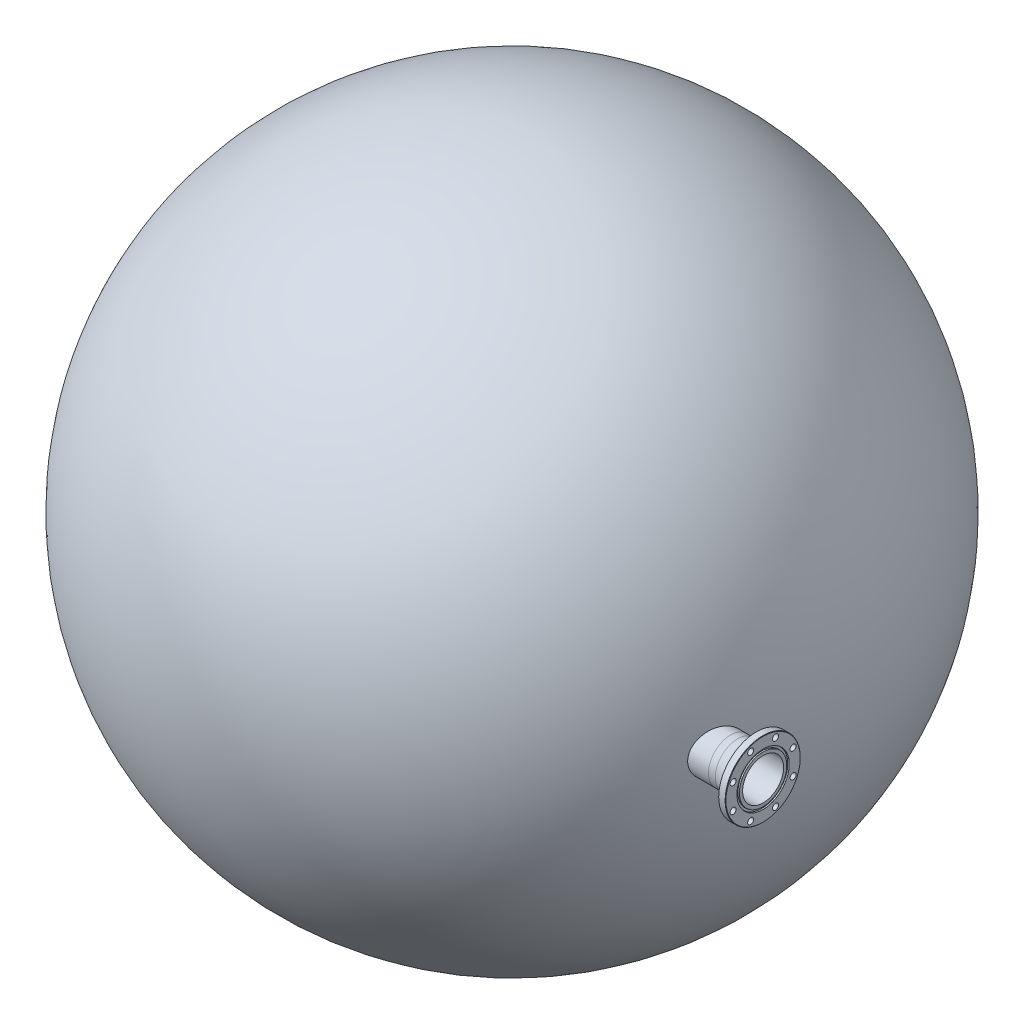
ISO-10303-21;
HEADER;
FILE_DESCRIPTION(('STEP AP214'),'2;1');
FILE_NAME('part.step','',(''),(''),'','','');
FILE_SCHEMA(('AUTOMOTIVE_DESIGN { 1 0 10303 214 1 1 1 1 }'));
ENDSEC;
DATA;
#1=APPLICATION_CONTEXT('core data for automotive mechanical design processes');
#2=APPLICATION_PROTOCOL_DEFINITION('international standard','automotive_design',2000,#1);
#3=PRODUCT_CONTEXT('',#1,'mechanical');
#4=PRODUCT('Part','Part','',(#3));
#5=PRODUCT_RELATED_PRODUCT_CATEGORY('part','',(#4));
#6=PRODUCT_DEFINITION_FORMATION('','',#4);
#7=PRODUCT_DEFINITION_CONTEXT('part definition',#1,'design');
#8=PRODUCT_DEFINITION('design','',#6,#7);
#9=PRODUCT_DEFINITION_SHAPE('','',#8);
#10=(LENGTH_UNIT() NAMED_UNIT(*) SI_UNIT(.MILLI.,.METRE.));
#11=(NAMED_UNIT(*) PLANE_ANGLE_UNIT() SI_UNIT($,.RADIAN.));
#12=(NAMED_UNIT(*) SI_UNIT($,.STERADIAN.) SOLID_ANGLE_UNIT());
#13=UNCERTAINTY_MEASURE_WITH_UNIT(LENGTH_MEASURE(1.E-05),#10,'distance_accuracy_value','');
#14=(GEOMETRIC_REPRESENTATION_CONTEXT(3) GLOBAL_UNCERTAINTY_ASSIGNED_CONTEXT((#13)) GLOBAL_UNIT_ASSIGNED_CONTEXT((#10,
#11,#12)) REPRESENTATION_CONTEXT('',''));
#15=CARTESIAN_POINT('',(0.,0.,0.));
#16=DIRECTION('',(0.,0.,1.));
#17=DIRECTION('',(1.,0.,0.));
#18=AXIS2_PLACEMENT_3D('',#15,#16,#17);
#19=CARTESIAN_POINT('',(-1206.5,0.,-393.7));
#20=DIRECTION('',(-1.,0.,0.));
#21=DIRECTION('',(0.,0.,-1.));
#22=AXIS2_PLACEMENT_3D('',#19,#20,#21);
#23=SPHERICAL_SURFACE('',#22,1225.55);
#24=CARTESIAN_POINT('',(-30.6418592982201,-55.0623669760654,-52.674245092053));
#25=CARTESIAN_POINT('',(-30.391752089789,-54.3477765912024,-53.4212355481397));
#26=CARTESIAN_POINT('',(-30.1463332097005,-53.6172371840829,-54.1544582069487));
#27=CARTESIAN_POINT('',(-29.6653217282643,-52.1252727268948,-55.5919840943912));
#28=CARTESIAN_POINT('',(-29.4297278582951,-51.3638516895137,-56.296291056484));
#29=CARTESIAN_POINT('',(-28.9687396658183,-49.8109899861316,-57.6748079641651));
#30=CARTESIAN_POINT('',(-28.7433473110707,-49.0195435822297,-58.3490121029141));
#31=CARTESIAN_POINT('',(-28.3032346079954,-47.4078919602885,-59.6658584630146));
#32=CARTESIAN_POINT('',(-28.0885146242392,-46.5876857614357,-60.3084996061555));
#33=CARTESIAN_POINT('',(-27.6700576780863,-44.9192960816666,-61.5612352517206));
#34=CARTESIAN_POINT('',(-27.4663271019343,-44.0710967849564,-62.1713108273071));
#35=CARTESIAN_POINT('',(-27.0703742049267,-42.3484048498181,-63.3572904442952));
#36=CARTESIAN_POINT('',(-26.8781529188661,-41.4739098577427,-63.9331914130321));
#37=CARTESIAN_POINT('',(-26.505656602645,-39.700200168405,-65.049458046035));
#38=CARTESIAN_POINT('',(-26.3253801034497,-38.8009885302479,-65.5898280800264));
#39=CARTESIAN_POINT('',(-25.9771094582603,-36.9791261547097,-66.633975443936));
#40=CARTESIAN_POINT('',(-25.80911644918,-36.0564732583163,-67.1377493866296));
#41=CARTESIAN_POINT('',(-25.4855555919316,-34.1879958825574,-68.1082285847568));
#42=CARTESIAN_POINT('',(-25.3300061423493,-33.2421396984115,-68.574878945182));
#43=CARTESIAN_POINT('',(-25.0319297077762,-31.3300820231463,-69.469274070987));
#44=CARTESIAN_POINT('',(-24.8894039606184,-30.3638786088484,-69.8970151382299));
#45=CARTESIAN_POINT('',(-24.6177188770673,-28.4129843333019,-70.7125164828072));
#46=CARTESIAN_POINT('',(-24.4885585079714,-27.4282949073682,-71.1002798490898));
#47=CARTESIAN_POINT('',(-24.2438715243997,-25.4420233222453,-71.8349832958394));
#48=CARTESIAN_POINT('',(-24.1283462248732,-24.4404395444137,-72.1819194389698));
#49=CARTESIAN_POINT('',(-23.9112438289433,-22.4226233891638,-72.8339877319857));
#50=CARTESIAN_POINT('',(-23.809662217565,-21.4063958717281,-73.1391334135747));
#51=CARTESIAN_POINT('',(-23.62062932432,-19.3607605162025,-73.7070410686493));
#52=CARTESIAN_POINT('',(-23.5331794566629,-18.3313513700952,-73.9697988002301));
#53=CARTESIAN_POINT('',(-23.3726371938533,-16.2614870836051,-74.4522195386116));
#54=CARTESIAN_POINT('',(-23.2995430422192,-15.2210333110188,-74.6718878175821));
#55=CARTESIAN_POINT('',(-23.1678673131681,-13.1309316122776,-75.067639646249));
#56=CARTESIAN_POINT('',(-23.1092871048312,-12.0812828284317,-75.2437190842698));
#57=CARTESIAN_POINT('',(-22.9585890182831,-8.98401438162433,-75.696709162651));
#58=CARTESIAN_POINT('',(-22.8867334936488,-6.92610659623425,-75.91273832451));
#59=CARTESIAN_POINT('',(-22.7989455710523,-2.79866213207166,-76.1766724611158));
#60=CARTESIAN_POINT('',(-22.7830120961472,-0.729125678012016,-76.2245806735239));
#61=CARTESIAN_POINT('',(-22.807186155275,3.40654838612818,-76.1518985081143));
#62=CARTESIAN_POINT('',(-22.8472888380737,5.47268627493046,-76.03132271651));
#63=CARTESIAN_POINT('',(-22.9831675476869,9.58647205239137,-75.6228290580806));
#64=CARTESIAN_POINT('',(-23.0789432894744,11.6341200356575,-75.3349120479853));
#65=CARTESIAN_POINT('',(-23.3233085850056,15.6632734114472,-74.6004520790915));
#66=CARTESIAN_POINT('',(-23.4710212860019,17.6453129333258,-74.1565428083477));
#67=CARTESIAN_POINT('',(-23.8182183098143,21.5633956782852,-73.1134037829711));
#68=CARTESIAN_POINT('',(-24.0177018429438,23.4994396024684,-72.5141763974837));
#69=CARTESIAN_POINT('',(-24.4667601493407,27.3125527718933,-71.1656810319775));
#70=CARTESIAN_POINT('',(-24.7163355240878,29.1896213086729,-70.4164112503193));
#71=CARTESIAN_POINT('',(-25.263527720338,32.872570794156,-68.7742648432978));
#72=CARTESIAN_POINT('',(-25.5611453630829,34.6784505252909,-67.8813857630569));
#73=CARTESIAN_POINT('',(-26.2073877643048,38.2370804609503,-65.943449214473));
#74=CARTESIAN_POINT('',(-26.5567786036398,39.9884473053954,-64.8961075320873));
#75=CARTESIAN_POINT('',(-27.2999936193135,43.3950917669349,-62.6693478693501));
#76=CARTESIAN_POINT('',(-27.6938180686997,45.0503687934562,-61.4899290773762));
#77=CARTESIAN_POINT('',(-28.5229482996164,48.2553153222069,-59.0082423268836));
#78=CARTESIAN_POINT('',(-28.9582589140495,49.8049724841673,-57.7059600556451));
#79=CARTESIAN_POINT('',(-29.8671457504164,52.7898832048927,-54.9885632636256));
#80=CARTESIAN_POINT('',(-30.3407229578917,54.2251338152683,-53.5734458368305));
#81=CARTESIAN_POINT('',(-31.3433964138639,57.0312415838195,-50.5792593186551));
#82=CARTESIAN_POINT('',(-31.8739867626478,58.3968894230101,-48.9958071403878));
#83=CARTESIAN_POINT('',(-32.9692544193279,60.9884904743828,-45.729538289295));
#84=CARTESIAN_POINT('',(-33.5339325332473,62.2144403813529,-44.0467192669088));
#85=CARTESIAN_POINT('',(-34.6935490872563,64.5206664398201,-40.5935353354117));
#86=CARTESIAN_POINT('',(-35.2884928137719,65.6009170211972,-38.8231551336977));
#87=CARTESIAN_POINT('',(-36.5045854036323,67.6103877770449,-35.20729990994));
#88=CARTESIAN_POINT('',(-37.1257349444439,68.5396040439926,-33.3618229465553));
#89=CARTESIAN_POINT('',(-38.4224734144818,70.2862371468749,-29.5123116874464));
#90=CARTESIAN_POINT('',(-39.0992238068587,71.0955507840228,-27.5049888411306));
#91=CARTESIAN_POINT('',(-40.4726357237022,72.5389988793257,-23.4349379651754));
#92=CARTESIAN_POINT('',(-41.1692978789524,73.1731277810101,-21.3722081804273));
#93=CARTESIAN_POINT('',(-42.5780214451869,74.2635038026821,-17.2049828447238));
#94=CARTESIAN_POINT('',(-43.2900856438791,74.7197184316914,-15.1004797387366));
#95=CARTESIAN_POINT('',(-44.7248577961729,75.452206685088,-10.8639749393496));
#96=CARTESIAN_POINT('',(-45.4475659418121,75.7284770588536,-8.73197274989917));
#97=CARTESIAN_POINT('',(-46.9282725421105,76.1074826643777,-4.36798163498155));
#98=CARTESIAN_POINT('',(-47.6865190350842,76.2027721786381,-2.1354271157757));
#99=CARTESIAN_POINT('',(-49.20428941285,76.1971048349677,2.32904078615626));
#100=CARTESIAN_POINT('',(-49.9638133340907,76.0961422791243,4.56095414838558));
#101=CARTESIAN_POINT('',(-51.4789602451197,75.6985144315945,9.00894615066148));
#102=CARTESIAN_POINT('',(-52.2345827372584,75.4018247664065,11.225022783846));
#103=CARTESIAN_POINT('',(-53.7365200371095,74.6141882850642,15.6255978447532));
#104=CARTESIAN_POINT('',(-54.4828348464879,74.1232415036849,17.8100962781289));
#105=CARTESIAN_POINT('',(-55.9697482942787,72.9423748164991,22.1582064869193));
#106=CARTESIAN_POINT('',(-56.7101685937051,72.2501199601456,24.3212459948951));
#107=CARTESIAN_POINT('',(-58.1703761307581,70.6725766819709,28.5830334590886));
#108=CARTESIAN_POINT('',(-58.8901630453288,69.7872852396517,30.6817804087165));
#109=CARTESIAN_POINT('',(-60.3033873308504,67.8283628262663,34.7987007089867));
#110=CARTESIAN_POINT('',(-60.9968254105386,66.7547369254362,36.8168762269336));
#111=CARTESIAN_POINT('',(-62.3516171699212,64.4250742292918,40.7564255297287));
#112=CARTESIAN_POINT('',(-63.0129717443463,63.169042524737,42.677802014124));
#113=CARTESIAN_POINT('',(-64.2824028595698,60.5141971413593,46.3627464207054));
#114=CARTESIAN_POINT('',(-64.8913772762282,59.1195350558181,48.1289954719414));
#115=CARTESIAN_POINT('',(-66.0679325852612,56.1717202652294,51.5388852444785));
#116=CARTESIAN_POINT('',(-66.6355137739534,54.6185686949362,53.1825268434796));
#117=CARTESIAN_POINT('',(-67.7238762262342,51.3639906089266,56.3321165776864));
#118=CARTESIAN_POINT('',(-68.244667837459,49.6625970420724,57.8380951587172));
#119=CARTESIAN_POINT('',(-69.2344447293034,46.1228038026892,60.6984687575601));
#120=CARTESIAN_POINT('',(-69.7034325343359,44.2844108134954,62.0528711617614));
#121=CARTESIAN_POINT('',(-70.5621736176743,40.5811944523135,64.5314986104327));
#122=CARTESIAN_POINT('',(-70.9547524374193,38.7225308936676,65.6639528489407));
#123=CARTESIAN_POINT('',(-71.6850007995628,34.9067238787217,67.769524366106));
#124=CARTESIAN_POINT('',(-72.0226720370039,32.949583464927,68.7426465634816));
#125=CARTESIAN_POINT('',(-72.6395214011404,28.9517016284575,70.5196631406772));
#126=CARTESIAN_POINT('',(-72.9187162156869,26.9109842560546,71.3236058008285));
#127=CARTESIAN_POINT('',(-73.4157154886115,22.7611010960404,72.7543034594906));
#128=CARTESIAN_POINT('',(-73.6335224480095,20.6519381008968,73.3810656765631));
#129=CARTESIAN_POINT('',(-73.9953638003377,16.4964328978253,74.42208842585));
#130=CARTESIAN_POINT('',(-74.1427243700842,14.4527756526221,74.8459318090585));
#131=CARTESIAN_POINT('',(-74.3787838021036,10.3342953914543,75.5248137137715));
#132=CARTESIAN_POINT('',(-74.467484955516,8.25947359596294,75.7798588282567));
#133=CARTESIAN_POINT('',(-74.5852940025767,4.09457717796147,76.1185856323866));
#134=CARTESIAN_POINT('',(-74.6144123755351,2.00450530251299,76.2022974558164));
#135=CARTESIAN_POINT('',(-74.6127807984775,-2.17541811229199,76.1976067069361));
#136=CARTESIAN_POINT('',(-74.5820315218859,-4.26526965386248,76.1092060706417));
#137=CARTESIAN_POINT('',(-74.4627626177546,-8.36803384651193,75.7662802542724));
#138=CARTESIAN_POINT('',(-74.3759569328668,-10.3814105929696,75.5166836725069));
#139=CARTESIAN_POINT('',(-74.1470921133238,-14.3787624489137,74.8584932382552));
#140=CARTESIAN_POINT('',(-74.005034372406,-16.3627382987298,74.4499033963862));
#141=CARTESIAN_POINT('',(-73.667041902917,-20.2875121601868,73.4775083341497));
#142=CARTESIAN_POINT('',(-73.4711083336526,-22.2283110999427,72.9137064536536));
#143=CARTESIAN_POINT('',(-73.0272103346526,-26.0537065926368,71.635962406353));
#144=CARTESIAN_POINT('',(-72.7792451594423,-27.9383023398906,70.9220180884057));
#145=CARTESIAN_POINT('',(-72.2314055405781,-31.6535666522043,69.344048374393));
#146=CARTESIAN_POINT('',(-71.9311379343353,-33.4836940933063,68.4788860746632));
#147=CARTESIAN_POINT('',(-71.2827493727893,-37.0627571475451,66.6098189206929));
#148=CARTESIAN_POINT('',(-70.9346284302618,-38.8116927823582,65.6059141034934));
#149=CARTESIAN_POINT('',(-70.1934854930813,-42.2180055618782,63.4675068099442));
#150=CARTESIAN_POINT('',(-69.8004587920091,-43.8753730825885,62.3329906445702));
#151=CARTESIAN_POINT('',(-68.9727576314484,-47.0888940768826,59.9423629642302));
#152=CARTESIAN_POINT('',(-68.5380820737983,-48.6450448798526,58.6862482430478));
#153=CARTESIAN_POINT('',(-67.6125266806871,-51.7071007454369,56.0099289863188));
#154=CARTESIAN_POINT('',(-67.1201040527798,-53.2085857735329,54.5852000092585));
#155=CARTESIAN_POINT('',(-66.0978791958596,-56.0847918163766,51.6255226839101));
#156=CARTESIAN_POINT('',(-65.5680761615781,-57.4595100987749,50.0905719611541));
#157=CARTESIAN_POINT('',(-64.4750305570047,-60.0752928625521,46.921438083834));
#158=CARTESIAN_POINT('',(-63.9117820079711,-61.3163333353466,45.2872371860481));
#159=CARTESIAN_POINT('',(-62.7560026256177,-63.6584384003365,41.9312610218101));
#160=CARTESIAN_POINT('',(-62.1634709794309,-64.7594991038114,40.2094833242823));
#161=CARTESIAN_POINT('',(-60.9206801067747,-66.871822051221,36.595251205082));
#162=CARTESIAN_POINT('',(-60.2690296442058,-67.875084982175,34.6985966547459));
#163=CARTESIAN_POINT('',(-58.942488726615,-69.7156449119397,30.8342275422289));
#164=CARTESIAN_POINT('',(-58.267597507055,-70.5529364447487,28.8665106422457));
#165=CARTESIAN_POINT('',(-56.8991824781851,-72.0577617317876,24.8731280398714));
#166=CARTESIAN_POINT('',(-56.2056557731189,-72.7252689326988,22.8474533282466));
#167=CARTESIAN_POINT('',(-54.8047290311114,-73.8873576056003,18.7517983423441));
#168=CARTESIAN_POINT('',(-54.0973287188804,-74.3819356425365,16.6818171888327));
#169=CARTESIAN_POINT('',(-52.6407342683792,-75.2145593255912,12.4155722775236));
#170=CARTESIAN_POINT('',(-51.8911063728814,-75.5444289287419,10.2178572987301));
#171=CARTESIAN_POINT('',(-50.3869239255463,-76.0110768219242,5.80364939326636));
#172=CARTESIAN_POINT('',(-49.6323692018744,-76.1478483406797,3.58715581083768));
#173=CARTESIAN_POINT('',(-48.1232332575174,-76.2275741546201,-0.850256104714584));
#174=CARTESIAN_POINT('',(-47.3686521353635,-76.1704549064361,-3.07117579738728));
#175=CARTESIAN_POINT('',(-45.8649144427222,-75.862375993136,-7.50135127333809));
#176=CARTESIAN_POINT('',(-45.1157578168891,-75.6114183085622,-9.71060717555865));
#177=CARTESIAN_POINT('',(-43.6138369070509,-74.9100743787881,-14.143994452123));
#178=CARTESIAN_POINT('',(-42.8612747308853,-74.4559879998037,-16.367610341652));
#179=CARTESIAN_POINT('',(-41.3724696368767,-73.3496200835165,-20.7708093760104));
#180=CARTESIAN_POINT('',(-40.636228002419,-72.6973230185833,-22.9503890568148));
#181=CARTESIAN_POINT('',(-39.1863342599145,-71.1985395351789,-27.2466302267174));
#182=CARTESIAN_POINT('',(-38.4726591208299,-70.3522588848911,-29.3633557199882));
#183=CARTESIAN_POINT('',(-37.0726213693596,-68.4696056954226,-33.5194711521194));
#184=CARTESIAN_POINT('',(-36.3862517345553,-67.4332824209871,-35.5588809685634));
#185=CARTESIAN_POINT('',(-35.2583225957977,-65.5336555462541,-38.9131120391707));
#186=CARTESIAN_POINT('',(-34.8080365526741,-64.7194037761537,-40.2529712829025));
#187=CARTESIAN_POINT('',(-34.145388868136,-63.4352855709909,-42.2258228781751));
#188=CARTESIAN_POINT('',(-33.9266529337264,-62.9968256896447,-42.8772349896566));
#189=CARTESIAN_POINT('',(-33.4935952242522,-62.0991958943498,-44.1672673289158));
#190=CARTESIAN_POINT('',(-33.2792740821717,-61.6400230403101,-44.805885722));
#191=CARTESIAN_POINT('',(-32.6433276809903,-60.2320674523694,-46.7013393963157));
#192=CARTESIAN_POINT('',(-32.2286469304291,-59.252707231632,-47.937989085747));
#193=CARTESIAN_POINT('',(-31.4195916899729,-57.2155128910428,-50.3519580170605));
#194=CARTESIAN_POINT('',(-31.0252180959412,-56.157675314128,-51.5292746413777));
#195=CARTESIAN_POINT('',(-30.6418592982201,-55.0623669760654,-52.674245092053));
#196=B_SPLINE_CURVE_WITH_KNOTS('',3,(#24,#25,#26,#27,#28,#29,#30,#31,#32,#33,#34,#35,#36,#37,
#38,#39,#40,#41,#42,#43,#44,#45,#46,#47,#48,#49,#50,#51,#52,#53,#54,#55,#56,#57,#58,#59,#60,#61,
#62,#63,#64,#65,#66,#67,#68,#69,#70,#71,#72,#73,#74,#75,#76,#77,#78,#79,#80,#81,#82,#83,#84,#85,
#86,#87,#88,#89,#90,#91,#92,#93,#94,#95,#96,#97,#98,#99,#100,#101,#102,#103,#104,#105,#106,#107,
#108,#109,#110,#111,#112,#113,#114,#115,#116,#117,#118,#119,#120,#121,#122,#123,#124,#125,#126,
#127,#128,#129,#130,#131,#132,#133,#134,#135,#136,#137,#138,#139,#140,#141,#142,#143,#144,#145,
#146,#147,#148,#149,#150,#151,#152,#153,#154,#155,#156,#157,#158,#159,#160,#161,#162,#163,#164,
#165,#166,#167,#168,#169,#170,#171,#172,#173,#174,#175,#176,#177,#178,#179,#180,#181,#182,#183,
#184,#185,#186,#187,#188,#189,#190,#191,#192,#193,#194,#195),.UNSPECIFIED.,.T.,.F.,(4,2,2,2,2,2,
2,2,2,2,2,2,2,2,2,2,2,2,2,2,2,2,2,2,2,2,2,2,2,2,2,2,2,2,2,2,2,2,2,2,2,2,2,2,2,2,2,2,2,2,2,2,2,2,
2,2,2,2,2,2,2,2,2,2,2,2,2,2,2,2,2,2,2,2,2,2,2,2,2,2,2,2,2,2,2,4),(0.,3.19039963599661,
6.3803860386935,9.57098515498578,12.7616931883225,15.9542358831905,19.1470651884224,
22.3395010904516,25.5322320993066,28.729599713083,31.9272709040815,35.1246948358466,
38.3224268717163,41.5191210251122,44.7161348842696,47.9127573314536,51.1096811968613,
57.312810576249,63.5158204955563,69.7182934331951,75.9207346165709,82.0231251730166,
88.1254226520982,94.2277934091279,100.330268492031,106.534248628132,112.738266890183,
118.94300877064,125.147910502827,131.612511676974,138.077265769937,144.543152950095,
151.009207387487,157.804546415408,164.600100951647,171.396895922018,178.193813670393,
185.264770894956,192.335933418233,199.407976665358,206.480018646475,213.637604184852,
220.795301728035,227.952806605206,235.110111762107,242.095593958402,249.081026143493,
256.064909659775,263.048452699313,269.674850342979,276.301043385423,282.925342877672,
289.549372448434,295.818653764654,302.087690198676,308.355623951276,314.623487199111,
320.70824146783,326.792842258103,332.877312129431,338.961869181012,345.094311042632,
351.226751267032,357.359834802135,363.493080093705,369.868848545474,376.244754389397,
382.621803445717,388.999029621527,395.718774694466,402.438741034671,409.159757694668,
415.880907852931,422.908867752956,429.937074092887,436.9679465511,443.998747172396,
451.163191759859,458.328197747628,465.485638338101,472.641226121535,477.532044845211,
479.977076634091,482.422456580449,487.31241504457,492.202589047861),.UNSPECIFIED.);
#197=CARTESIAN_POINT('',(-30.6418592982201,-55.0623669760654,-52.674245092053));
#198=VERTEX_POINT('',#197);
#199=EDGE_CURVE('E12',#198,#198,#196,.T.);
#200=ORIENTED_EDGE('',*,*,#199,.T.);
#201=EDGE_LOOP('',(#200));
#202=FACE_BOUND('',#201,.T.);
#203=CARTESIAN_POINT('',(-29.6242016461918,-59.7163890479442,-56.9952257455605));
#204=CARTESIAN_POINT('',(-29.353156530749,-58.9430859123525,-57.805451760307));
#205=CARTESIAN_POINT('',(-29.0871880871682,-58.1524838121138,-58.6007786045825));
#206=CARTESIAN_POINT('',(-28.5658899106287,-56.5377771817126,-60.1601326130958));
#207=CARTESIAN_POINT('',(-28.310558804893,-55.7136770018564,-60.924163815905));
#208=CARTESIAN_POINT('',(-27.8109383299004,-54.0329115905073,-62.419649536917));
#209=CARTESIAN_POINT('',(-27.5666510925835,-53.1762401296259,-63.1510977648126));
#210=CARTESIAN_POINT('',(-27.0896287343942,-51.4316969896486,-64.5798283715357));
#211=CARTESIAN_POINT('',(-26.8568940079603,-50.543824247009,-65.2771095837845));
#212=CARTESIAN_POINT('',(-26.40331190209,-48.737723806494,-66.6364386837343));
#213=CARTESIAN_POINT('',(-26.1824714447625,-47.8194789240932,-67.298466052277));
#214=CARTESIAN_POINT('',(-25.7532457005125,-45.9544577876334,-68.5855241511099));
#215=CARTESIAN_POINT('',(-25.5448615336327,-45.0076789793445,-69.2105515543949));
#216=CARTESIAN_POINT('',(-25.1410215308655,-43.0872937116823,-70.4221301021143));
#217=CARTESIAN_POINT('',(-24.9455641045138,-42.1136905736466,-71.0086859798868));
#218=CARTESIAN_POINT('',(-24.5679403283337,-40.1410430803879,-72.1421742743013));
#219=CARTESIAN_POINT('',(-24.3857752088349,-39.1419963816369,-72.6891030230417));
#220=CARTESIAN_POINT('',(-24.0348899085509,-37.1187549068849,-73.7428190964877));
#221=CARTESIAN_POINT('',(-23.8661895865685,-36.0945257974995,-74.2495471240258));
#222=CARTESIAN_POINT('',(-23.542879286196,-34.0239760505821,-75.2208703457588));
#223=CARTESIAN_POINT('',(-23.3882706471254,-32.9776533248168,-75.6854615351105));
#224=CARTESIAN_POINT('',(-23.0935153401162,-30.8649279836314,-76.5713439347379));
#225=CARTESIAN_POINT('',(-22.9533675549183,-29.7985269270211,-76.9926384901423));
#226=CARTESIAN_POINT('',(-22.6878226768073,-27.6473716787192,-77.7910128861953));
#227=CARTESIAN_POINT('',(-22.5624270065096,-26.5626157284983,-78.16808846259));
#228=CARTESIAN_POINT('',(-22.3267263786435,-24.3771805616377,-78.87695970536));
#229=CARTESIAN_POINT('',(-22.216416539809,-23.2765066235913,-79.2087700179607));
#230=CARTESIAN_POINT('',(-22.0110842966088,-21.0608256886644,-79.8264806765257));
#231=CARTESIAN_POINT('',(-21.9160634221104,-19.9458172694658,-80.1123764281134));
#232=CARTESIAN_POINT('',(-21.7415548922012,-17.703778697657,-80.6374849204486));
#233=CARTESIAN_POINT('',(-21.6620653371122,-16.5767500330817,-80.8767033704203));
#234=CARTESIAN_POINT('',(-21.5187873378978,-14.3126765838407,-81.3079239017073));
#235=CARTESIAN_POINT('',(-21.455000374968,-13.1756308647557,-81.4999215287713));
#236=CARTESIAN_POINT('',(-21.2907527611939,-9.82029225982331,-81.9943327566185));
#237=CARTESIAN_POINT('',(-21.212216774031,-7.59077461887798,-82.2307806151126));
#238=CARTESIAN_POINT('',(-21.1156583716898,-3.11892639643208,-82.5214949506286));
#239=CARTESIAN_POINT('',(-21.0976347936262,-0.876596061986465,-82.5757649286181));
#240=CARTESIAN_POINT('',(-21.122235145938,3.60459412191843,-82.5016957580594));
#241=CARTESIAN_POINT('',(-21.1648538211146,5.84345425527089,-82.3733724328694));
#242=CARTESIAN_POINT('',(-21.3103495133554,10.3013488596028,-81.9353471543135));
#243=CARTESIAN_POINT('',(-21.4132262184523,12.5203834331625,-81.625646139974));
#244=CARTESIAN_POINT('',(-21.6761612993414,16.8868935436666,-80.8342669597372));
#245=CARTESIAN_POINT('',(-21.8352681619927,19.0349459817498,-80.3554506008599));
#246=CARTESIAN_POINT('',(-22.2095353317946,23.2814011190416,-79.229438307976));
#247=CARTESIAN_POINT('',(-22.4246947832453,25.3798045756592,-78.5822449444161));
#248=CARTESIAN_POINT('',(-22.9092614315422,29.5128853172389,-77.1251813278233));
#249=CARTESIAN_POINT('',(-23.1786692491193,31.5475618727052,-76.3153092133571));
#250=CARTESIAN_POINT('',(-23.7695278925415,35.5399409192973,-74.5398430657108));
#251=CARTESIAN_POINT('',(-24.0909796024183,37.4976421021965,-73.5742463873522));
#252=CARTESIAN_POINT('',(-24.789082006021,41.3553209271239,-71.478232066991));
#253=CARTESIAN_POINT('',(-25.1665545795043,43.2538169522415,-70.3453619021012));
#254=CARTESIAN_POINT('',(-25.9696522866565,46.9468540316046,-67.9364118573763));
#255=CARTESIAN_POINT('',(-26.3952777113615,48.7413944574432,-66.6603311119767));
#256=CARTESIAN_POINT('',(-27.2915004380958,52.216188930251,-63.9749487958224));
#257=CARTESIAN_POINT('',(-27.7621029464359,53.8964297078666,-62.565631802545));
#258=CARTESIAN_POINT('',(-28.7448133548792,57.1330780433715,-59.6246231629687));
#259=CARTESIAN_POINT('',(-29.2569223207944,58.689482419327,-58.0929283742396));
#260=CARTESIAN_POINT('',(-30.3412142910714,61.7324020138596,-54.8521377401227));
#261=CARTESIAN_POINT('',(-30.915011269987,63.2133034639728,-53.1383094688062));
#262=CARTESIAN_POINT('',(-32.0996083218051,66.0239008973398,-49.602894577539));
#263=CARTESIAN_POINT('',(-32.7104092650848,67.3535933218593,-47.781305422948));
#264=CARTESIAN_POINT('',(-33.9648847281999,69.8552819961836,-44.0431713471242));
#265=CARTESIAN_POINT('',(-34.6085649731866,71.0272506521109,-42.1266098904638));
#266=CARTESIAN_POINT('',(-35.9244210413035,73.2076786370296,-38.2120182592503));
#267=CARTESIAN_POINT('',(-36.5965976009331,74.21613373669,-36.2139859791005));
#268=CARTESIAN_POINT('',(-37.9999610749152,76.1120525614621,-32.0462459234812));
#269=CARTESIAN_POINT('',(-38.7324105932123,76.9907560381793,-29.8729748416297));
#270=CARTESIAN_POINT('',(-40.219021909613,78.5585148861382,-25.4662907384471));
#271=CARTESIAN_POINT('',(-40.9731843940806,79.2475642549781,-23.2328758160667));
#272=CARTESIAN_POINT('',(-42.4983454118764,80.433084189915,-18.7206760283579));
#273=CARTESIAN_POINT('',(-43.2693469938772,80.9295195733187,-16.4418829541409));
#274=CARTESIAN_POINT('',(-44.8230442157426,81.7275789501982,-11.8543765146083));
#275=CARTESIAN_POINT('',(-45.6057400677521,82.0291994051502,-9.54566260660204));
#276=CARTESIAN_POINT('',(-47.2096308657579,82.4446911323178,-4.81950881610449));
#277=CARTESIAN_POINT('',(-48.0311024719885,82.5504746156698,-2.40144842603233));
#278=CARTESIAN_POINT('',(-49.6756206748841,82.5495221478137,2.43413966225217));
#279=CARTESIAN_POINT('',(-50.4986673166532,82.4427800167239,4.85166734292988));
#280=CARTESIAN_POINT('',(-52.1407295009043,82.0173626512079,9.66974697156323));
#281=CARTESIAN_POINT('',(-52.9597445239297,81.6986607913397,12.0702967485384));
#282=CARTESIAN_POINT('',(-54.5878824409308,80.8508908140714,16.8373713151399));
#283=CARTESIAN_POINT('',(-55.3970053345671,80.3218226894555,19.2038961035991));
#284=CARTESIAN_POINT('',(-57.0094975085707,79.0480357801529,23.9152307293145));
#285=CARTESIAN_POINT('',(-57.8126714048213,78.3007271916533,26.2594085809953));
#286=CARTESIAN_POINT('',(-59.3968120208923,76.5969839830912,30.8782241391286));
#287=CARTESIAN_POINT('',(-60.1777783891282,75.640546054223,33.1528607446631));
#288=CARTESIAN_POINT('',(-61.7114363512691,73.5233487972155,37.615369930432));
#289=CARTESIAN_POINT('',(-62.4641286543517,72.3625945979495,39.8032446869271));
#290=CARTESIAN_POINT('',(-63.5670126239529,70.4735688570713,43.0060095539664));
#291=CARTESIAN_POINT('',(-63.9303285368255,69.819146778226,44.0605595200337));
#292=CARTESIAN_POINT('',(-64.6475140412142,68.4618689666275,46.1412735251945));
#293=CARTESIAN_POINT('',(-65.0013846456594,67.7590184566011,47.1674406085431));
#294=CARTESIAN_POINT('',(-65.6906452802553,66.3231117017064,49.1652808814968));
#295=CARTESIAN_POINT('',(-66.02627447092,65.591163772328,50.1376689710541));
#296=CARTESIAN_POINT('',(-66.6870304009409,64.0832185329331,52.0511982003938));
#297=CARTESIAN_POINT('',(-67.0121582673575,63.3072259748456,52.9923426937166));
#298=CARTESIAN_POINT('',(-67.651253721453,61.7122092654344,54.841561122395));
#299=CARTESIAN_POINT('',(-67.9652201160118,60.8931805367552,55.7496315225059));
#300=CARTESIAN_POINT('',(-68.5812022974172,59.2135307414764,57.5304987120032));
#301=CARTESIAN_POINT('',(-68.88321933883,58.3529140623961,58.4032992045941));
#302=CARTESIAN_POINT('',(-69.4745898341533,56.5914923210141,60.1116510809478));
#303=CARTESIAN_POINT('',(-69.7639446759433,55.6906916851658,60.9472065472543));
#304=CARTESIAN_POINT('',(-70.3292917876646,53.8504087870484,62.5791360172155));
#305=CARTESIAN_POINT('',(-70.6052854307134,52.9109305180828,63.3755140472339));
#306=CARTESIAN_POINT('',(-71.1432547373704,50.9948057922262,64.9272839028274));
#307=CARTESIAN_POINT('',(-71.405230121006,50.0181585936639,65.6826749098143));
#308=CARTESIAN_POINT('',(-71.9144770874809,48.0294656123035,67.1505791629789));
#309=CARTESIAN_POINT('',(-72.1617489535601,47.0174205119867,67.8630932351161));
#310=CARTESIAN_POINT('',(-72.6286755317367,45.0124327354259,69.2081295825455));
#311=CARTESIAN_POINT('',(-72.849095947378,44.021161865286,69.8428793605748));
#312=CARTESIAN_POINT('',(-73.2755696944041,42.0101198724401,71.0706706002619));
#313=CARTESIAN_POINT('',(-73.4816232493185,40.9903491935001,71.6637127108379));
#314=CARTESIAN_POINT('',(-73.8788548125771,38.9240522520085,72.8066940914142));
#315=CARTESIAN_POINT('',(-74.0700322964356,37.8775250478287,73.3566318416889));
#316=CARTESIAN_POINT('',(-74.4369928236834,35.7597478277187,74.4119779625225));
#317=CARTESIAN_POINT('',(-74.6127774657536,34.6885003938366,74.917390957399));
#318=CARTESIAN_POINT('',(-74.9484821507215,32.5233548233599,75.8823985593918));
#319=CARTESIAN_POINT('',(-75.1084050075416,31.4294607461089,76.3420012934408));
#320=CARTESIAN_POINT('',(-75.4119764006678,29.2210269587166,77.2142696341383));
#321=CARTESIAN_POINT('',(-75.5556266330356,28.1064894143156,77.6269401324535));
#322=CARTESIAN_POINT('',(-75.826281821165,25.8587956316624,78.4043324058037));
#323=CARTESIAN_POINT('',(-75.9532864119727,24.7256389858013,78.7690531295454));
#324=CARTESIAN_POINT('',(-76.1902921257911,22.4429791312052,79.4495660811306));
#325=CARTESIAN_POINT('',(-76.3002934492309,21.2934761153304,79.7653588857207));
#326=CARTESIAN_POINT('',(-76.4975211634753,19.0427653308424,80.3314922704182));
#327=CARTESIAN_POINT('',(-76.5856553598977,17.9422927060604,80.5844427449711));
#328=CARTESIAN_POINT('',(-76.7462084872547,15.7306936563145,81.0451955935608));
#329=CARTESIAN_POINT('',(-76.8186260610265,14.6195663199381,81.2529940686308));
#330=CARTESIAN_POINT('',(-76.9475398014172,12.3889588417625,81.6228775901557));
#331=CARTESIAN_POINT('',(-77.0040380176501,11.2694797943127,81.7849685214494));
#332=CARTESIAN_POINT('',(-77.1009827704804,9.02401006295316,82.063083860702));
#333=CARTESIAN_POINT('',(-77.1414277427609,7.89801875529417,82.1791037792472));
#334=CARTESIAN_POINT('',(-77.2061428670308,5.6420656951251,82.3647387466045));
#335=CARTESIAN_POINT('',(-77.2304174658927,4.51210512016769,82.434366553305));
#336=CARTESIAN_POINT('',(-77.2627472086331,2.24993056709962,82.5270982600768));
#337=CARTESIAN_POINT('',(-77.2708007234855,1.11771637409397,82.550197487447));
#338=CARTESIAN_POINT('',(-77.2706621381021,-1.14657922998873,82.5497999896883));
#339=CARTESIAN_POINT('',(-77.262471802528,-2.27866064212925,82.5263083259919));
#340=CARTESIAN_POINT('',(-77.2298690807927,-4.54077424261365,82.4327935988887));
#341=CARTESIAN_POINT('',(-77.2054551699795,-5.67080622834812,82.3627661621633));
#342=CARTESIAN_POINT('',(-77.1414299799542,-7.89319275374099,82.1791101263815));
#343=CARTESIAN_POINT('',(-77.1022897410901,-8.98567279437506,82.0668329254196));
#344=CARTESIAN_POINT('',(-77.0088858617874,-11.1647444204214,81.7988763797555));
#345=CARTESIAN_POINT('',(-76.9546208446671,-12.2513354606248,81.6431930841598));
#346=CARTESIAN_POINT('',(-76.8311068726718,-14.4165051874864,81.2888058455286));
#347=CARTESIAN_POINT('',(-76.7618597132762,-15.4950848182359,81.090107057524));
#348=CARTESIAN_POINT('',(-76.6085504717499,-17.6424957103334,80.6501500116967));
#349=CARTESIAN_POINT('',(-76.5244870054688,-18.711326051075,80.4088877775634));
#350=CARTESIAN_POINT('',(-76.2503762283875,-21.9001494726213,79.6220874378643));
#351=CARTESIAN_POINT('',(-76.0383726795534,-24.0031020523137,79.0134328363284));
#352=CARTESIAN_POINT('',(-75.5579050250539,-28.1480005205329,77.6335348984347));
#353=CARTESIAN_POINT('',(-75.2894401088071,-30.1899455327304,76.8622892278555));
#354=CARTESIAN_POINT('',(-74.696186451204,-34.2155435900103,75.1572596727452));
#355=CARTESIAN_POINT('',(-74.3709743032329,-36.1986170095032,74.2222537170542));
#356=CARTESIAN_POINT('',(-73.668625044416,-40.076968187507,72.2019420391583));
#357=CARTESIAN_POINT('',(-73.2914879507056,-41.9722459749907,71.1166363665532));
#358=CARTESIAN_POINT('',(-72.4884989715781,-45.6638042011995,68.8045296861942));
#359=CARTESIAN_POINT('',(-72.0626419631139,-47.4600741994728,67.5777137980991));
#360=CARTESIAN_POINT('',(-71.1657525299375,-50.9431499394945,64.9923261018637));
#361=CARTESIAN_POINT('',(-70.6947189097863,-52.6299527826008,63.6337508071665));
#362=CARTESIAN_POINT('',(-69.6916483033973,-55.9495748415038,60.7386878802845));
#363=CARTESIAN_POINT('',(-69.1579324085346,-57.5775965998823,59.1972799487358));
#364=CARTESIAN_POINT('',(-68.0499653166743,-60.6964779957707,55.9949649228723));
#365=CARTESIAN_POINT('',(-67.4757132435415,-62.1873346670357,54.3340552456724));
#366=CARTESIAN_POINT('',(-66.2909576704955,-65.0244197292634,50.9046236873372));
#367=CARTESIAN_POINT('',(-65.6804476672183,-66.3706220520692,49.136082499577));
#368=CARTESIAN_POINT('',(-64.4276945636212,-68.9115435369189,45.5040024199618));
#369=CARTESIAN_POINT('',(-63.7854505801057,-70.1062584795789,43.6404608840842));
#370=CARTESIAN_POINT('',(-62.4382880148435,-72.3988685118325,39.7280757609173));
#371=CARTESIAN_POINT('',(-61.731857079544,-73.4880757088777,37.6746582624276));
#372=CARTESIAN_POINT('',(-60.2938248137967,-75.4867883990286,33.4906413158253));
#373=CARTESIAN_POINT('',(-59.5622226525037,-76.3962879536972,31.3600393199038));
#374=CARTESIAN_POINT('',(-58.0788511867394,-78.0314640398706,27.0358459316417));
#375=CARTESIAN_POINT('',(-57.3270787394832,-78.7571117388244,24.8422447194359));
#376=CARTESIAN_POINT('',(-55.8085326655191,-80.0211353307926,20.4068244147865));
#377=CARTESIAN_POINT('',(-55.041758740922,-80.5595075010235,18.1650043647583));
#378=CARTESIAN_POINT('',(-53.4628824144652,-81.4668802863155,13.5441538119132));
#379=CARTESIAN_POINT('',(-52.6503108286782,-81.8270080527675,11.1635373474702));
#380=CARTESIAN_POINT('',(-51.019874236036,-82.338075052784,6.38170385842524));
#381=CARTESIAN_POINT('',(-50.202009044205,-82.4890069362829,3.98048611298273));
#382=CARTESIAN_POINT('',(-48.5662978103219,-82.5808737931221,-0.826999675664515));
#383=CARTESIAN_POINT('',(-47.7484518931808,-82.5217290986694,-3.23326928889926));
#384=CARTESIAN_POINT('',(-46.1186861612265,-82.1933934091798,-8.03342575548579));
#385=CARTESIAN_POINT('',(-45.3067662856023,-81.9242045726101,-10.4273127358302));
#386=CARTESIAN_POINT('',(-43.6790906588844,-81.1697682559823,-15.2313721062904));
#387=CARTESIAN_POINT('',(-42.8635543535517,-80.6805187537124,-17.6409918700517));
#388=CARTESIAN_POINT('',(-41.2502058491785,-79.4872228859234,-22.4127787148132));
#389=CARTESIAN_POINT('',(-40.4523950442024,-78.7831596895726,-24.774942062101));
#390=CARTESIAN_POINT('',(-38.8812842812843,-77.1645519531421,-29.4313420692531));
#391=CARTESIAN_POINT('',(-38.1079593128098,-76.2502306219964,-31.7256478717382));
#392=CARTESIAN_POINT('',(-36.5909264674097,-74.2155277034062,-36.2307026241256));
#393=CARTESIAN_POINT('',(-35.8472109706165,-73.0951995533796,-38.4414730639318));
#394=CARTESIAN_POINT('',(-34.6251844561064,-71.0413360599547,-42.0773773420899));
#395=CARTESIAN_POINT('',(-34.1374107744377,-70.1610037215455,-43.5295931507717));
#396=CARTESIAN_POINT('',(-33.4195915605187,-68.7725171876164,-45.6679926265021));
#397=CARTESIAN_POINT('',(-33.1826431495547,-68.298396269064,-46.3740853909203));
#398=CARTESIAN_POINT('',(-32.7135258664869,-67.3277115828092,-47.7724433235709));
#399=CARTESIAN_POINT('',(-32.481357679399,-66.8311446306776,-48.4647065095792));
#400=CARTESIAN_POINT('',(-31.7924499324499,-65.3084579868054,-50.5194399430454));
#401=CARTESIAN_POINT('',(-31.3432287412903,-64.2492008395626,-51.860087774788));
#402=CARTESIAN_POINT('',(-30.4667650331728,-62.0456336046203,-54.4772283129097));
#403=CARTESIAN_POINT('',(-30.0395234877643,-60.9013197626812,-55.7537181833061));
#404=CARTESIAN_POINT('',(-29.6242016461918,-59.7163890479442,-56.9952257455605));
#405=B_SPLINE_CURVE_WITH_KNOTS('',3,(#203,#204,#205,#206,#207,#208,#209,#210,#211,#212,#213,
#214,#215,#216,#217,#218,#219,#220,#221,#222,#223,#224,#225,#226,#227,#228,#229,#230,#231,#232,
#233,#234,#235,#236,#237,#238,#239,#240,#241,#242,#243,#244,#245,#246,#247,#248,#249,#250,#251,
#252,#253,#254,#255,#256,#257,#258,#259,#260,#261,#262,#263,#264,#265,#266,#267,#268,#269,#270,
#271,#272,#273,#274,#275,#276,#277,#278,#279,#280,#281,#282,#283,#284,#285,#286,#287,#288,#289,
#290,#291,#292,#293,#294,#295,#296,#297,#298,#299,#300,#301,#302,#303,#304,#305,#306,#307,#308,
#309,#310,#311,#312,#313,#314,#315,#316,#317,#318,#319,#320,#321,#322,#323,#324,#325,#326,#327,
#328,#329,#330,#331,#332,#333,#334,#335,#336,#337,#338,#339,#340,#341,#342,#343,#344,#345,#346,
#347,#348,#349,#350,#351,#352,#353,#354,#355,#356,#357,#358,#359,#360,#361,#362,#363,#364,#365,
#366,#367,#368,#369,#370,#371,#372,#373,#374,#375,#376,#377,#378,#379,#380,#381,#382,#383,#384,
#385,#386,#387,#388,#389,#390,#391,#392,#393,#394,#395,#396,#397,#398,#399,#400,#401,#402,#403,
#404),.UNSPECIFIED.,.T.,.F.,(4,2,2,2,2,2,2,2,2,2,2,2,2,2,2,2,2,2,2,2,2,2,2,2,2,2,2,2,2,2,2,2,2,
2,2,2,2,2,2,2,2,2,2,2,2,2,2,2,2,2,2,2,2,2,2,2,2,2,2,2,2,2,2,2,2,2,2,2,2,2,2,2,2,2,2,2,2,2,2,2,2,
2,2,2,2,2,2,2,2,2,2,2,2,2,2,2,2,2,2,2,4),(0.,3.45672820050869,6.91300891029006,10.3699540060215,
13.8270170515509,17.2860707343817,20.7454349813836,24.2043728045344,27.6636303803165,
31.1278990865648,34.592496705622,38.0568264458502,41.5214899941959,44.9850298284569,
48.4489160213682,51.9123782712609,55.3761670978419,62.0974052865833,68.81851431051,
75.5390409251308,82.2595327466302,88.8713557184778,95.4830777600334,102.094875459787,
108.706785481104,115.427586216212,122.148427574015,128.87004784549,135.591840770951,
142.593695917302,149.595715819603,156.598959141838,163.60238357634,170.961940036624,
178.321729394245,185.682862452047,193.04412921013,200.703153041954,208.362399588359,
216.022608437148,223.682817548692,231.437903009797,239.193111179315,246.94812470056,
250.826672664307,254.704803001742,258.491164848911,262.277118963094,266.063476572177,
269.849435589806,273.63497859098,277.420131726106,281.205360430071,284.990516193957,
288.582013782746,292.173455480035,295.765023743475,299.356218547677,302.946775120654,
306.536957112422,310.127217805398,313.717436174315,317.114203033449,320.511263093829,
323.907885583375,327.304838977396,330.700857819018,334.097217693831,337.493208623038,
340.889518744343,344.185337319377,347.481455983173,350.777179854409,354.073211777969,
360.663372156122,367.253627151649,373.895338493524,380.537047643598,387.179455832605,
393.822039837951,400.728184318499,407.634478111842,414.542014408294,421.449743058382,
428.729749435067,436.00999633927,443.291384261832,450.57291692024,458.187488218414,
465.802327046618,473.420053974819,481.037702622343,488.799867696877,496.562641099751,
504.317211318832,512.06977286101,517.367207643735,520.015515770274,522.664200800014,
527.960703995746,533.257441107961),.UNSPECIFIED.);
#406=CARTESIAN_POINT('',(-29.6242016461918,-59.7163890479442,-56.9952257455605));
#407=VERTEX_POINT('',#406);
#408=EDGE_CURVE('E56',#407,#407,#405,.T.);
#409=ORIENTED_EDGE('',*,*,#408,.F.);
#410=EDGE_LOOP('',(#409));
#411=FACE_BOUND('',#410,.T.);
#412=ADVANCED_FACE('F46',(#202,#411),#23,.F.);
#413=CARTESIAN_POINT('',(0.,0.,0.));
#414=DIRECTION('',(-1.,0.,0.));
#415=DIRECTION('',(0.,0.,1.));
#416=AXIS2_PLACEMENT_3D('',#413,#414,#415);
#417=PLANE('',#416);
#418=CARTESIAN_POINT('',(0.,0.,0.));
#419=DIRECTION('',(-1.,0.,0.));
#420=DIRECTION('',(0.,0.,1.));
#421=AXIS2_PLACEMENT_3D('',#418,#419,#420);
#422=CIRCLE('',#421,76.2);
#423=CARTESIAN_POINT('',(0.,0.,76.2));
#424=VERTEX_POINT('',#423);
#425=EDGE_CURVE('E60',#424,#424,#422,.T.);
#426=ORIENTED_EDGE('',*,*,#425,.T.);
#427=EDGE_LOOP('',(#426));
#428=FACE_BOUND('',#427,.T.);
#429=CARTESIAN_POINT('',(0.,0.,0.));
#430=DIRECTION('',(-1.,0.,0.));
#431=DIRECTION('',(0.,0.,1.));
#432=AXIS2_PLACEMENT_3D('',#429,#430,#431);
#433=CIRCLE('',#432,82.55);
#434=CARTESIAN_POINT('',(0.,0.,82.55));
#435=VERTEX_POINT('',#434);
#436=EDGE_CURVE('E64',#435,#435,#433,.T.);
#437=ORIENTED_EDGE('',*,*,#436,.F.);
#438=EDGE_LOOP('',(#437));
#439=FACE_BOUND('',#438,.T.);
#440=ADVANCED_FACE('F73',(#428,#439),#417,.F.);
#441=CARTESIAN_POINT('',(-500000.,0.,0.));
#442=DIRECTION('',(1.,0.,0.));
#443=DIRECTION('',(0.,0.,-1.));
#444=AXIS2_PLACEMENT_3D('',#441,#442,#443);
#445=CYLINDRICAL_SURFACE('',#444,82.55);
#446=ORIENTED_EDGE('',*,*,#408,.T.);
#447=EDGE_LOOP('',(#446));
#448=FACE_BOUND('',#447,.T.);
#449=ORIENTED_EDGE('',*,*,#436,.T.);
#450=EDGE_LOOP('',(#449));
#451=FACE_BOUND('',#450,.T.);
#452=ADVANCED_FACE('F69',(#448,#451),#445,.T.);
#453=CARTESIAN_POINT('',(-500000.,0.,0.));
#454=DIRECTION('',(1.,0.,0.));
#455=DIRECTION('',(0.,0.,-1.));
#456=AXIS2_PLACEMENT_3D('',#453,#454,#455);
#457=CYLINDRICAL_SURFACE('',#456,76.2);
#458=ORIENTED_EDGE('',*,*,#199,.F.);
#459=EDGE_LOOP('',(#458));
#460=FACE_BOUND('',#459,.T.);
#461=ORIENTED_EDGE('',*,*,#425,.F.);
#462=EDGE_LOOP('',(#461));
#463=FACE_BOUND('',#462,.T.);
#464=ADVANCED_FACE('F72',(#460,#463),#457,.F.);
#465=CLOSED_SHELL('',(#412,#440,#452,#464));
#466=MANIFOLD_SOLID_BREP('B2',#465);
#467=CARTESIAN_POINT('',(-1206.5,0.,-393.7));
#468=DIRECTION('',(-1.,0.,0.));
#469=DIRECTION('',(0.,0.,-1.));
#470=AXIS2_PLACEMENT_3D('',#467,#468,#469);
#471=SPHERICAL_SURFACE('',#470,1225.55);
#472=CARTESIAN_POINT('',(-2432.05,0.,-393.7));
#473=VERTEX_POINT('',#472);
#474=VERTEX_LOOP('',#473);
#475=FACE_BOUND('',#474,.T.);
#476=ADVANCED_FACE('F123',(#475),#471,.T.);
#477=CLOSED_SHELL('',(#476));
#478=MANIFOLD_SOLID_BREP('B7_NOT_SHOWN',#477);
#479=CARTESIAN_POINT('',(0.,0.,-82.55));
#480=DIRECTION('',(1.,0.,0.));
#481=DIRECTION('',(0.,0.,-1.));
#482=AXIS2_PLACEMENT_3D('',#479,#480,#481);
#483=PLANE('',#482);
#484=CARTESIAN_POINT('',(0.,0.,0.));
#485=DIRECTION('',(-1.,0.,0.));
#486=DIRECTION('',(0.,0.,1.));
#487=AXIS2_PLACEMENT_3D('',#484,#485,#486);
#488=CIRCLE('',#487,76.2);
#489=CARTESIAN_POINT('',(0.,0.,76.2));
#490=VERTEX_POINT('',#489);
#491=EDGE_CURVE('E156',#490,#490,#488,.T.);
#492=ORIENTED_EDGE('',*,*,#491,.F.);
#493=EDGE_LOOP('',(#492));
#494=FACE_BOUND('',#493,.T.);
#495=CARTESIAN_POINT('',(0.,0.,0.));
#496=DIRECTION('',(-1.,0.,0.));
#497=DIRECTION('',(0.,0.,1.));
#498=AXIS2_PLACEMENT_3D('',#495,#496,#497);
#499=CIRCLE('',#498,82.55);
#500=CARTESIAN_POINT('',(0.,0.,82.55));
#501=VERTEX_POINT('',#500);
#502=EDGE_CURVE('E210',#501,#501,#499,.T.);
#503=ORIENTED_EDGE('',*,*,#502,.T.);
#504=EDGE_LOOP('',(#503));
#505=FACE_BOUND('',#504,.T.);
#506=ADVANCED_FACE('F136',(#494,#505),#483,.F.);
#507=CARTESIAN_POINT('',(0.,0.,0.));
#508=DIRECTION('',(-1.,0.,0.));
#509=DIRECTION('',(0.,0.,1.));
#510=AXIS2_PLACEMENT_3D('',#507,#508,#509);
#511=CYLINDRICAL_SURFACE('',#510,76.2);
#512=CARTESIAN_POINT('',(120.65,0.,0.));
#513=DIRECTION('',(-1.,0.,0.));
#514=DIRECTION('',(0.,0.,1.));
#515=AXIS2_PLACEMENT_3D('',#512,#513,#514);
#516=CIRCLE('',#515,76.2);
#517=CARTESIAN_POINT('',(120.65,0.,76.2));
#518=VERTEX_POINT('',#517);
#519=EDGE_CURVE('E177',#518,#518,#516,.T.);
#520=ORIENTED_EDGE('',*,*,#519,.F.);
#521=EDGE_LOOP('',(#520));
#522=FACE_BOUND('',#521,.T.);
#523=ORIENTED_EDGE('',*,*,#491,.T.);
#524=EDGE_LOOP('',(#523));
#525=FACE_BOUND('',#524,.T.);
#526=ADVANCED_FACE('F314',(#522,#525),#511,.F.);
#527=CARTESIAN_POINT('',(120.65,0.,-76.2));
#528=DIRECTION('',(-1.,0.,0.));
#529=DIRECTION('',(0.,0.,1.));
#530=AXIS2_PLACEMENT_3D('',#527,#528,#529);
#531=PLANE('',#530);
#532=CARTESIAN_POINT('',(120.65,0.,0.));
#533=DIRECTION('',(-1.,0.,0.));
#534=DIRECTION('',(0.,0.,1.));
#535=AXIS2_PLACEMENT_3D('',#532,#533,#534);
#536=CIRCLE('',#535,88.0194613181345);
#537=CARTESIAN_POINT('',(120.65,0.,88.0194613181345));
#538=VERTEX_POINT('',#537);
#539=EDGE_CURVE('E180',#538,#538,#536,.T.);
#540=ORIENTED_EDGE('',*,*,#539,.F.);
#541=EDGE_LOOP('',(#540));
#542=FACE_BOUND('',#541,.T.);
#543=ORIENTED_EDGE('',*,*,#519,.T.);
#544=EDGE_LOOP('',(#543));
#545=FACE_BOUND('',#544,.T.);
#546=ADVANCED_FACE('F308',(#542,#545),#531,.F.);
#547=CARTESIAN_POINT('',(120.523,0.,0.));
#548=DIRECTION('',(-1.,0.,0.));
#549=DIRECTION('',(0.,0.,1.));
#550=AXIS2_PLACEMENT_3D('',#547,#548,#549);
#551=TOROIDAL_SURFACE('',#550,88.0194613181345,0.126999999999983);
#552=CARTESIAN_POINT('',(120.534068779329,0.,0.));
#553=DIRECTION('',(-1.,0.,0.));
#554=DIRECTION('',(0.,0.,1.));
#555=AXIS2_PLACEMENT_3D('',#552,#553,#554);
#556=CIRCLE('',#555,88.1459780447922);
#557=CARTESIAN_POINT('',(120.534068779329,0.,88.1459780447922));
#558=VERTEX_POINT('',#557);
#559=EDGE_CURVE('E183',#558,#558,#556,.T.);
#560=ORIENTED_EDGE('',*,*,#559,.F.);
#561=EDGE_LOOP('',(#560));
#562=FACE_BOUND('',#561,.T.);
#563=ORIENTED_EDGE('',*,*,#539,.T.);
#564=EDGE_LOOP('',(#563));
#565=FACE_BOUND('',#564,.T.);
#566=ADVANCED_FACE('F302',(#562,#565),#551,.T.);
#567=CARTESIAN_POINT('',(120.534068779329,0.,0.));
#568=DIRECTION('',(-1.,0.,0.));
#569=DIRECTION('',(0.,0.,1.));
#570=AXIS2_PLACEMENT_3D('',#567,#568,#569);
#571=CONICAL_SURFACE('',#570,88.1459780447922,0.0872664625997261);
#572=CARTESIAN_POINT('',(115.660531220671,0.,0.));
#573=DIRECTION('',(-1.,0.,0.));
#574=DIRECTION('',(0.,0.,1.));
#575=AXIS2_PLACEMENT_3D('',#572,#573,#574);
#576=CIRCLE('',#575,88.5723573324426);
#577=CARTESIAN_POINT('',(115.660531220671,0.,88.5723573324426));
#578=VERTEX_POINT('',#577);
#579=EDGE_CURVE('E186',#578,#578,#576,.T.);
#580=ORIENTED_EDGE('',*,*,#579,.F.);
#581=EDGE_LOOP('',(#580));
#582=FACE_BOUND('',#581,.T.);
#583=ORIENTED_EDGE('',*,*,#559,.T.);
#584=EDGE_LOOP('',(#583));
#585=FACE_BOUND('',#584,.T.);
#586=ADVANCED_FACE('F296',(#582,#585),#571,.T.);
#587=CARTESIAN_POINT('',(115.6716,0.,0.));
#588=DIRECTION('',(-1.,0.,0.));
#589=DIRECTION('',(0.,0.,1.));
#590=AXIS2_PLACEMENT_3D('',#587,#588,#589);
#591=TOROIDAL_SURFACE('',#590,88.6988740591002,0.12699999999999);
#592=CARTESIAN_POINT('',(115.5446,0.,0.));
#593=DIRECTION('',(-1.,0.,0.));
#594=DIRECTION('',(0.,0.,1.));
#595=AXIS2_PLACEMENT_3D('',#592,#593,#594);
#596=CIRCLE('',#595,88.6988740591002);
#597=CARTESIAN_POINT('',(115.5446,0.,88.6988740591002));
#598=VERTEX_POINT('',#597);
#599=EDGE_CURVE('E189',#598,#598,#596,.T.);
#600=ORIENTED_EDGE('',*,*,#599,.F.);
#601=EDGE_LOOP('',(#600));
#602=FACE_BOUND('',#601,.T.);
#603=ORIENTED_EDGE('',*,*,#579,.T.);
#604=EDGE_LOOP('',(#603));
#605=FACE_BOUND('',#604,.T.);
#606=ADVANCED_FACE('F290',(#602,#605),#591,.F.);
#607=CARTESIAN_POINT('',(115.5446,0.,-88.6988740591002));
#608=DIRECTION('',(-1.,0.,0.));
#609=DIRECTION('',(0.,0.,1.));
#610=AXIS2_PLACEMENT_3D('',#607,#608,#609);
#611=PLANE('',#610);
#612=CARTESIAN_POINT('',(115.5446,0.,0.));
#613=DIRECTION('',(-1.,0.,0.));
#614=DIRECTION('',(0.,0.,1.));
#615=AXIS2_PLACEMENT_3D('',#612,#613,#614);
#616=CIRCLE('',#615,96.6449259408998);
#617=CARTESIAN_POINT('',(115.5446,0.,96.6449259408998));
#618=VERTEX_POINT('',#617);
#619=EDGE_CURVE('E192',#618,#618,#616,.T.);
#620=ORIENTED_EDGE('',*,*,#619,.F.);
#621=EDGE_LOOP('',(#620));
#622=FACE_BOUND('',#621,.T.);
#623=ORIENTED_EDGE('',*,*,#599,.T.);
#624=EDGE_LOOP('',(#623));
#625=FACE_BOUND('',#624,.T.);
#626=ADVANCED_FACE('F284',(#622,#625),#611,.F.);
#627=CARTESIAN_POINT('',(115.6716,0.,0.));
#628=DIRECTION('',(-1.,0.,0.));
#629=DIRECTION('',(0.,0.,1.));
#630=AXIS2_PLACEMENT_3D('',#627,#628,#629);
#631=TOROIDAL_SURFACE('',#630,96.6449259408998,0.12699999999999);
#632=CARTESIAN_POINT('',(115.660531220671,0.,0.));
#633=DIRECTION('',(-1.,0.,0.));
#634=DIRECTION('',(0.,0.,1.));
#635=AXIS2_PLACEMENT_3D('',#632,#633,#634);
#636=CIRCLE('',#635,96.7714426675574);
#637=CARTESIAN_POINT('',(115.660531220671,0.,96.7714426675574));
#638=VERTEX_POINT('',#637);
#639=EDGE_CURVE('E195',#638,#638,#636,.T.);
#640=ORIENTED_EDGE('',*,*,#639,.F.);
#641=EDGE_LOOP('',(#640));
#642=FACE_BOUND('',#641,.T.);
#643=ORIENTED_EDGE('',*,*,#619,.T.);
#644=EDGE_LOOP('',(#643));
#645=FACE_BOUND('',#644,.T.);
#646=ADVANCED_FACE('F278',(#642,#645),#631,.F.);
#647=CARTESIAN_POINT('',(115.660531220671,0.,0.));
#648=DIRECTION('',(1.,0.,0.));
#649=DIRECTION('',(0.,0.,-1.));
#650=AXIS2_PLACEMENT_3D('',#647,#648,#649);
#651=CONICAL_SURFACE('',#650,96.7714426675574,0.0872664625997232);
#652=CARTESIAN_POINT('',(120.534068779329,0.,0.));
#653=DIRECTION('',(-1.,0.,0.));
#654=DIRECTION('',(0.,0.,1.));
#655=AXIS2_PLACEMENT_3D('',#652,#653,#654);
#656=CIRCLE('',#655,97.1978219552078);
#657=CARTESIAN_POINT('',(120.534068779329,0.,97.1978219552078));
#658=VERTEX_POINT('',#657);
#659=EDGE_CURVE('E198',#658,#658,#656,.T.);
#660=ORIENTED_EDGE('',*,*,#659,.F.);
#661=EDGE_LOOP('',(#660));
#662=FACE_BOUND('',#661,.T.);
#663=ORIENTED_EDGE('',*,*,#639,.T.);
#664=EDGE_LOOP('',(#663));
#665=FACE_BOUND('',#664,.T.);
#666=ADVANCED_FACE('F272',(#662,#665),#651,.F.);
#667=CARTESIAN_POINT('',(120.523,0.,0.));
#668=DIRECTION('',(-1.,0.,0.));
#669=DIRECTION('',(0.,0.,1.));
#670=AXIS2_PLACEMENT_3D('',#667,#668,#669);
#671=TOROIDAL_SURFACE('',#670,97.3243386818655,0.126999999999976);
#672=CARTESIAN_POINT('',(120.65,0.,0.));
#673=DIRECTION('',(-1.,0.,0.));
#674=DIRECTION('',(0.,0.,1.));
#675=AXIS2_PLACEMENT_3D('',#672,#673,#674);
#676=CIRCLE('',#675,97.3243386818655);
#677=CARTESIAN_POINT('',(120.65,0.,97.3243386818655));
#678=VERTEX_POINT('',#677);
#679=EDGE_CURVE('E201',#678,#678,#676,.T.);
#680=ORIENTED_EDGE('',*,*,#679,.F.);
#681=EDGE_LOOP('',(#680));
#682=FACE_BOUND('',#681,.T.);
#683=ORIENTED_EDGE('',*,*,#659,.T.);
#684=EDGE_LOOP('',(#683));
#685=FACE_BOUND('',#684,.T.);
#686=ADVANCED_FACE('F251',(#682,#685),#671,.T.);
#687=CARTESIAN_POINT('',(120.65,0.,-97.3243386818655));
#688=DIRECTION('',(-1.,0.,0.));
#689=DIRECTION('',(0.,0.,1.));
#690=AXIS2_PLACEMENT_3D('',#687,#688,#689);
#691=PLANE('',#690);
#692=CARTESIAN_POINT('',(120.65,0.,0.));
#693=DIRECTION('',(-1.,0.,0.));
#694=DIRECTION('',(0.,0.,1.));
#695=AXIS2_PLACEMENT_3D('',#692,#693,#694);
#696=CIRCLE('',#695,138.1125);
#697=CARTESIAN_POINT('',(120.65,0.,138.1125));
#698=VERTEX_POINT('',#697);
#699=EDGE_CURVE('E147',#698,#698,#696,.F.);
#700=ORIENTED_EDGE('',*,*,#699,.T.);
#701=EDGE_LOOP('',(#700));
#702=FACE_BOUND('',#701,.T.);
#703=CARTESIAN_POINT('',(120.65,111.466065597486,46.1707561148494));
#704=DIRECTION('',(1.,0.,0.));
#705=DIRECTION('',(0.,0.,-1.));
#706=AXIS2_PLACEMENT_3D('',#703,#704,#705);
#707=CIRCLE('',#706,11.1125);
#708=CARTESIAN_POINT('',(120.65,111.466065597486,35.0582561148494));
#709=VERTEX_POINT('',#708);
#710=EDGE_CURVE('E161',#709,#709,#707,.T.);
#711=ORIENTED_EDGE('',*,*,#710,.F.);
#712=EDGE_LOOP('',(#711));
#713=FACE_BOUND('',#712,.T.);
#714=CARTESIAN_POINT('',(120.65,111.466065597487,-46.170756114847));
#715=DIRECTION('',(1.,0.,0.));
#716=DIRECTION('',(0.,0.,-1.));
#717=AXIS2_PLACEMENT_3D('',#714,#715,#716);
#718=CIRCLE('',#717,11.1125);
#719=CARTESIAN_POINT('',(120.65,111.466065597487,-57.283256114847));
#720=VERTEX_POINT('',#719);
#721=EDGE_CURVE('E160',#720,#720,#718,.T.);
#722=ORIENTED_EDGE('',*,*,#721,.F.);
#723=EDGE_LOOP('',(#722));
#724=FACE_BOUND('',#723,.T.);
#725=CARTESIAN_POINT('',(120.65,46.170756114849,-111.466065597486));
#726=DIRECTION('',(1.,0.,0.));
#727=DIRECTION('',(0.,0.,-1.));
#728=AXIS2_PLACEMENT_3D('',#725,#726,#727);
#729=CIRCLE('',#728,11.1125);
#730=CARTESIAN_POINT('',(120.65,46.170756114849,-122.578565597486));
#731=VERTEX_POINT('',#730);
#732=EDGE_CURVE('E165',#731,#731,#729,.T.);
#733=ORIENTED_EDGE('',*,*,#732,.F.);
#734=EDGE_LOOP('',(#733));
#735=FACE_BOUND('',#734,.T.);
#736=CARTESIAN_POINT('',(120.65,-46.1707561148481,-111.466065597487));
#737=DIRECTION('',(1.,0.,0.));
#738=DIRECTION('',(0.,0.,-1.));
#739=AXIS2_PLACEMENT_3D('',#736,#737,#738);
#740=CIRCLE('',#739,11.1125);
#741=CARTESIAN_POINT('',(120.65,-46.1707561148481,-122.578565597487));
#742=VERTEX_POINT('',#741);
#743=EDGE_CURVE('E231',#742,#742,#740,.T.);
#744=ORIENTED_EDGE('',*,*,#743,.F.);
#745=EDGE_LOOP('',(#744));
#746=FACE_BOUND('',#745,.T.);
#747=CARTESIAN_POINT('',(120.65,-111.466065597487,-46.1707561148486));
#748=DIRECTION('',(1.,0.,0.));
#749=DIRECTION('',(0.,0.,-1.));
#750=AXIS2_PLACEMENT_3D('',#747,#748,#749);
#751=CIRCLE('',#750,11.1125);
#752=CARTESIAN_POINT('',(120.65,-111.466065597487,-57.2832561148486));
#753=VERTEX_POINT('',#752);
#754=EDGE_CURVE('E170',#753,#753,#751,.T.);
#755=ORIENTED_EDGE('',*,*,#754,.F.);
#756=EDGE_LOOP('',(#755));
#757=FACE_BOUND('',#756,.T.);
#758=CARTESIAN_POINT('',(120.65,-111.466065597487,46.1707561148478));
#759=DIRECTION('',(1.,0.,0.));
#760=DIRECTION('',(0.,0.,-1.));
#761=AXIS2_PLACEMENT_3D('',#758,#759,#760);
#762=CIRCLE('',#761,11.1125);
#763=CARTESIAN_POINT('',(120.65,-111.466065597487,35.0582561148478));
#764=VERTEX_POINT('',#763);
#765=EDGE_CURVE('E169',#764,#764,#762,.T.);
#766=ORIENTED_EDGE('',*,*,#765,.F.);
#767=EDGE_LOOP('',(#766));
#768=FACE_BOUND('',#767,.T.);
#769=CARTESIAN_POINT('',(120.65,-46.1707561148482,111.466065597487));
#770=DIRECTION('',(1.,0.,0.));
#771=DIRECTION('',(0.,0.,-1.));
#772=AXIS2_PLACEMENT_3D('',#769,#770,#771);
#773=CIRCLE('',#772,11.1125);
#774=CARTESIAN_POINT('',(120.65,-46.1707561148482,100.353565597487));
#775=VERTEX_POINT('',#774);
#776=EDGE_CURVE('E174',#775,#775,#773,.T.);
#777=ORIENTED_EDGE('',*,*,#776,.F.);
#778=EDGE_LOOP('',(#777));
#779=FACE_BOUND('',#778,.T.);
#780=CARTESIAN_POINT('',(120.65,46.1707561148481,111.466065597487));
#781=DIRECTION('',(1.,0.,0.));
#782=DIRECTION('',(0.,0.,-1.));
#783=AXIS2_PLACEMENT_3D('',#780,#781,#782);
#784=CIRCLE('',#783,11.1125);
#785=CARTESIAN_POINT('',(120.65,46.1707561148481,100.353565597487));
#786=VERTEX_POINT('',#785);
#787=EDGE_CURVE('E216',#786,#786,#784,.T.);
#788=ORIENTED_EDGE('',*,*,#787,.F.);
#789=EDGE_LOOP('',(#788));
#790=FACE_BOUND('',#789,.T.);
#791=ORIENTED_EDGE('',*,*,#679,.T.);
#792=EDGE_LOOP('',(#791));
#793=FACE_BOUND('',#792,.T.);
#794=ADVANCED_FACE('F247',(#702,#713,#724,#735,#746,#757,#768,#779,#790,#793),#691,.F.);
#795=CARTESIAN_POINT('',(0.,0.,0.));
#796=DIRECTION('',(-1.,0.,0.));
#797=DIRECTION('',(0.,0.,1.));
#798=AXIS2_PLACEMENT_3D('',#795,#796,#797);
#799=CYLINDRICAL_SURFACE('',#798,139.7);
#800=CARTESIAN_POINT('',(119.0625,0.,0.));
#801=DIRECTION('',(-1.,0.,0.));
#802=DIRECTION('',(0.,0.,1.));
#803=AXIS2_PLACEMENT_3D('',#800,#801,#802);
#804=CIRCLE('',#803,139.7);
#805=CARTESIAN_POINT('',(119.0625,0.,139.7));
#806=VERTEX_POINT('',#805);
#807=EDGE_CURVE('E151',#806,#806,#804,.T.);
#808=ORIENTED_EDGE('',*,*,#807,.T.);
#809=EDGE_LOOP('',(#808));
#810=FACE_BOUND('',#809,.T.);
#811=CARTESIAN_POINT('',(95.25,0.,0.));
#812=DIRECTION('',(-1.,0.,0.));
#813=DIRECTION('',(0.,0.,1.));
#814=AXIS2_PLACEMENT_3D('',#811,#812,#813);
#815=CIRCLE('',#814,139.7);
#816=CARTESIAN_POINT('',(95.25,0.,139.7));
#817=VERTEX_POINT('',#816);
#818=EDGE_CURVE('E204',#817,#817,#815,.T.);
#819=ORIENTED_EDGE('',*,*,#818,.F.);
#820=EDGE_LOOP('',(#819));
#821=FACE_BOUND('',#820,.T.);
#822=ADVANCED_FACE('F250',(#810,#821),#799,.T.);
#823=CARTESIAN_POINT('',(95.25,0.,-139.7));
#824=DIRECTION('',(1.,0.,0.));
#825=DIRECTION('',(0.,0.,-1.));
#826=AXIS2_PLACEMENT_3D('',#823,#824,#825);
#827=PLANE('',#826);
#828=CARTESIAN_POINT('',(95.25,0.,0.));
#829=DIRECTION('',(1.,0.,0.));
#830=DIRECTION('',(0.,0.,-1.));
#831=AXIS2_PLACEMENT_3D('',#828,#829,#830);
#832=CIRCLE('',#831,103.199339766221);
#833=CARTESIAN_POINT('',(95.25,0.,-103.199339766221));
#834=VERTEX_POINT('',#833);
#835=EDGE_CURVE('E122',#834,#834,#832,.T.);
#836=ORIENTED_EDGE('',*,*,#835,.T.);
#837=EDGE_LOOP('',(#836));
#838=FACE_BOUND('',#837,.T.);
#839=CARTESIAN_POINT('',(95.25,111.466065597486,46.1707561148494));
#840=DIRECTION('',(1.,0.,0.));
#841=DIRECTION('',(0.,0.,-1.));
#842=AXIS2_PLACEMENT_3D('',#839,#840,#841);
#843=CIRCLE('',#842,11.1125);
#844=CARTESIAN_POINT('',(95.25,111.466065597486,35.0582561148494));
#845=VERTEX_POINT('',#844);
#846=EDGE_CURVE('E157',#845,#845,#843,.T.);
#847=ORIENTED_EDGE('',*,*,#846,.T.);
#848=EDGE_LOOP('',(#847));
#849=FACE_BOUND('',#848,.T.);
#850=CARTESIAN_POINT('',(95.25,111.466065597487,-46.170756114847));
#851=DIRECTION('',(1.,0.,0.));
#852=DIRECTION('',(0.,0.,-1.));
#853=AXIS2_PLACEMENT_3D('',#850,#851,#852);
#854=CIRCLE('',#853,11.1125);
#855=CARTESIAN_POINT('',(95.25,111.466065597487,-57.283256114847));
#856=VERTEX_POINT('',#855);
#857=EDGE_CURVE('E162',#856,#856,#854,.T.);
#858=ORIENTED_EDGE('',*,*,#857,.T.);
#859=EDGE_LOOP('',(#858));
#860=FACE_BOUND('',#859,.T.);
#861=CARTESIAN_POINT('',(95.25,46.170756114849,-111.466065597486));
#862=DIRECTION('',(1.,0.,0.));
#863=DIRECTION('',(0.,0.,-1.));
#864=AXIS2_PLACEMENT_3D('',#861,#862,#863);
#865=CIRCLE('',#864,11.1125);
#866=CARTESIAN_POINT('',(95.25,46.170756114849,-122.578565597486));
#867=VERTEX_POINT('',#866);
#868=EDGE_CURVE('E234',#867,#867,#865,.T.);
#869=ORIENTED_EDGE('',*,*,#868,.T.);
#870=EDGE_LOOP('',(#869));
#871=FACE_BOUND('',#870,.T.);
#872=CARTESIAN_POINT('',(95.25,-46.1707561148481,-111.466065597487));
#873=DIRECTION('',(1.,0.,0.));
#874=DIRECTION('',(0.,0.,-1.));
#875=AXIS2_PLACEMENT_3D('',#872,#873,#874);
#876=CIRCLE('',#875,11.1125);
#877=CARTESIAN_POINT('',(95.25,-46.1707561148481,-122.578565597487));
#878=VERTEX_POINT('',#877);
#879=EDGE_CURVE('E228',#878,#878,#876,.T.);
#880=ORIENTED_EDGE('',*,*,#879,.T.);
#881=EDGE_LOOP('',(#880));
#882=FACE_BOUND('',#881,.T.);
#883=CARTESIAN_POINT('',(95.25,-111.466065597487,-46.1707561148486));
#884=DIRECTION('',(1.,0.,0.));
#885=DIRECTION('',(0.,0.,-1.));
#886=AXIS2_PLACEMENT_3D('',#883,#884,#885);
#887=CIRCLE('',#886,11.1125);
#888=CARTESIAN_POINT('',(95.25,-111.466065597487,-57.2832561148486));
#889=VERTEX_POINT('',#888);
#890=EDGE_CURVE('E166',#889,#889,#887,.T.);
#891=ORIENTED_EDGE('',*,*,#890,.T.);
#892=EDGE_LOOP('',(#891));
#893=FACE_BOUND('',#892,.T.);
#894=CARTESIAN_POINT('',(95.25,-111.466065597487,46.1707561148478));
#895=DIRECTION('',(1.,0.,0.));
#896=DIRECTION('',(0.,0.,-1.));
#897=AXIS2_PLACEMENT_3D('',#894,#895,#896);
#898=CIRCLE('',#897,11.1125);
#899=CARTESIAN_POINT('',(95.25,-111.466065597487,35.0582561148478));
#900=VERTEX_POINT('',#899);
#901=EDGE_CURVE('E171',#900,#900,#898,.T.);
#902=ORIENTED_EDGE('',*,*,#901,.T.);
#903=EDGE_LOOP('',(#902));
#904=FACE_BOUND('',#903,.T.);
#905=CARTESIAN_POINT('',(95.25,-46.1707561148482,111.466065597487));
#906=DIRECTION('',(1.,0.,0.));
#907=DIRECTION('',(0.,0.,-1.));
#908=AXIS2_PLACEMENT_3D('',#905,#906,#907);
#909=CIRCLE('',#908,11.1125);
#910=CARTESIAN_POINT('',(95.25,-46.1707561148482,100.353565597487));
#911=VERTEX_POINT('',#910);
#912=EDGE_CURVE('E219',#911,#911,#909,.T.);
#913=ORIENTED_EDGE('',*,*,#912,.T.);
#914=EDGE_LOOP('',(#913));
#915=FACE_BOUND('',#914,.T.);
#916=CARTESIAN_POINT('',(95.25,46.1707561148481,111.466065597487));
#917=DIRECTION('',(1.,0.,0.));
#918=DIRECTION('',(0.,0.,-1.));
#919=AXIS2_PLACEMENT_3D('',#916,#917,#918);
#920=CIRCLE('',#919,11.1125);
#921=CARTESIAN_POINT('',(95.25,46.1707561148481,100.353565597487));
#922=VERTEX_POINT('',#921);
#923=EDGE_CURVE('E213',#922,#922,#920,.T.);
#924=ORIENTED_EDGE('',*,*,#923,.T.);
#925=EDGE_LOOP('',(#924));
#926=FACE_BOUND('',#925,.T.);
#927=ORIENTED_EDGE('',*,*,#818,.T.);
#928=EDGE_LOOP('',(#927));
#929=FACE_BOUND('',#928,.T.);
#930=ADVANCED_FACE('F337',(#838,#849,#860,#871,#882,#893,#904,#915,#926,#929),#827,.F.);
#931=CARTESIAN_POINT('',(95.25,0.,0.));
#932=DIRECTION('',(1.,0.,0.));
#933=DIRECTION('',(0.,0.,-1.));
#934=AXIS2_PLACEMENT_3D('',#931,#932,#933);
#935=CONICAL_SURFACE('',#934,95.25,0.179853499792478);
#936=CARTESIAN_POINT('',(87.4288837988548,0.,0.));
#937=DIRECTION('',(1.,0.,0.));
#938=DIRECTION('',(0.,0.,-1.));
#939=AXIS2_PLACEMENT_3D('',#936,#937,#938);
#940=CIRCLE('',#939,93.8279788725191);
#941=CARTESIAN_POINT('',(87.4288837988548,0.,-93.8279788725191));
#942=VERTEX_POINT('',#941);
#943=EDGE_CURVE('E143',#942,#942,#940,.F.);
#944=ORIENTED_EDGE('',*,*,#943,.T.);
#945=EDGE_LOOP('',(#944));
#946=FACE_BOUND('',#945,.T.);
#947=CARTESIAN_POINT('',(25.4,0.,0.));
#948=DIRECTION('',(-1.,0.,0.));
#949=DIRECTION('',(0.,0.,1.));
#950=AXIS2_PLACEMENT_3D('',#947,#948,#949);
#951=CIRCLE('',#950,82.55);
#952=CARTESIAN_POINT('',(25.4,0.,82.55));
#953=VERTEX_POINT('',#952);
#954=EDGE_CURVE('E207',#953,#953,#951,.T.);
#955=ORIENTED_EDGE('',*,*,#954,.F.);
#956=EDGE_LOOP('',(#955));
#957=FACE_BOUND('',#956,.T.);
#958=ADVANCED_FACE('F332',(#946,#957),#935,.T.);
#959=CARTESIAN_POINT('',(0.,0.,0.));
#960=DIRECTION('',(-1.,0.,0.));
#961=DIRECTION('',(0.,0.,1.));
#962=AXIS2_PLACEMENT_3D('',#959,#960,#961);
#963=CYLINDRICAL_SURFACE('',#962,82.55);
#964=ORIENTED_EDGE('',*,*,#502,.F.);
#965=EDGE_LOOP('',(#964));
#966=FACE_BOUND('',#965,.T.);
#967=ORIENTED_EDGE('',*,*,#954,.T.);
#968=EDGE_LOOP('',(#967));
#969=FACE_BOUND('',#968,.T.);
#970=ADVANCED_FACE('F328',(#966,#969),#963,.T.);
#971=CARTESIAN_POINT('',(120.65,46.1707561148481,111.466065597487));
#972=DIRECTION('',(1.,0.,0.));
#973=DIRECTION('',(0.,0.,-1.));
#974=AXIS2_PLACEMENT_3D('',#971,#972,#973);
#975=CYLINDRICAL_SURFACE('',#974,11.1125);
#976=ORIENTED_EDGE('',*,*,#787,.T.);
#977=EDGE_LOOP('',(#976));
#978=FACE_BOUND('',#977,.T.);
#979=ORIENTED_EDGE('',*,*,#923,.F.);
#980=EDGE_LOOP('',(#979));
#981=FACE_BOUND('',#980,.T.);
#982=ADVANCED_FACE('F331',(#978,#981),#975,.F.);
#983=CARTESIAN_POINT('',(120.65,-46.1707561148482,111.466065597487));
#984=DIRECTION('',(1.,0.,0.));
#985=DIRECTION('',(0.,0.,-1.));
#986=AXIS2_PLACEMENT_3D('',#983,#984,#985);
#987=CYLINDRICAL_SURFACE('',#986,11.1125);
#988=ORIENTED_EDGE('',*,*,#776,.T.);
#989=EDGE_LOOP('',(#988));
#990=FACE_BOUND('',#989,.T.);
#991=ORIENTED_EDGE('',*,*,#912,.F.);
#992=EDGE_LOOP('',(#991));
#993=FACE_BOUND('',#992,.T.);
#994=ADVANCED_FACE('F384',(#990,#993),#987,.F.);
#995=CARTESIAN_POINT('',(120.65,-111.466065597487,46.1707561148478));
#996=DIRECTION('',(1.,0.,0.));
#997=DIRECTION('',(0.,0.,-1.));
#998=AXIS2_PLACEMENT_3D('',#995,#996,#997);
#999=CYLINDRICAL_SURFACE('',#998,11.1125);
#1000=ORIENTED_EDGE('',*,*,#765,.T.);
#1001=EDGE_LOOP('',(#1000));
#1002=FACE_BOUND('',#1001,.T.);
#1003=ORIENTED_EDGE('',*,*,#901,.F.);
#1004=EDGE_LOOP('',(#1003));
#1005=FACE_BOUND('',#1004,.T.);
#1006=ADVANCED_FACE('F380',(#1002,#1005),#999,.F.);
#1007=CARTESIAN_POINT('',(120.65,-111.466065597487,-46.1707561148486));
#1008=DIRECTION('',(1.,0.,0.));
#1009=DIRECTION('',(0.,0.,-1.));
#1010=AXIS2_PLACEMENT_3D('',#1007,#1008,#1009);
#1011=CYLINDRICAL_SURFACE('',#1010,11.1125);
#1012=ORIENTED_EDGE('',*,*,#754,.T.);
#1013=EDGE_LOOP('',(#1012));
#1014=FACE_BOUND('',#1013,.T.);
#1015=ORIENTED_EDGE('',*,*,#890,.F.);
#1016=EDGE_LOOP('',(#1015));
#1017=FACE_BOUND('',#1016,.T.);
#1018=ADVANCED_FACE('F376',(#1014,#1017),#1011,.F.);
#1019=CARTESIAN_POINT('',(120.65,-46.1707561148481,-111.466065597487));
#1020=DIRECTION('',(1.,0.,0.));
#1021=DIRECTION('',(0.,0.,-1.));
#1022=AXIS2_PLACEMENT_3D('',#1019,#1020,#1021);
#1023=CYLINDRICAL_SURFACE('',#1022,11.1125);
#1024=ORIENTED_EDGE('',*,*,#743,.T.);
#1025=EDGE_LOOP('',(#1024));
#1026=FACE_BOUND('',#1025,.T.);
#1027=ORIENTED_EDGE('',*,*,#879,.F.);
#1028=EDGE_LOOP('',(#1027));
#1029=FACE_BOUND('',#1028,.T.);
#1030=ADVANCED_FACE('F372',(#1026,#1029),#1023,.F.);
#1031=CARTESIAN_POINT('',(120.65,46.170756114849,-111.466065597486));
#1032=DIRECTION('',(1.,0.,0.));
#1033=DIRECTION('',(0.,0.,-1.));
#1034=AXIS2_PLACEMENT_3D('',#1031,#1032,#1033);
#1035=CYLINDRICAL_SURFACE('',#1034,11.1125);
#1036=ORIENTED_EDGE('',*,*,#732,.T.);
#1037=EDGE_LOOP('',(#1036));
#1038=FACE_BOUND('',#1037,.T.);
#1039=ORIENTED_EDGE('',*,*,#868,.F.);
#1040=EDGE_LOOP('',(#1039));
#1041=FACE_BOUND('',#1040,.T.);
#1042=ADVANCED_FACE('F366',(#1038,#1041),#1035,.F.);
#1043=CARTESIAN_POINT('',(120.65,111.466065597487,-46.170756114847));
#1044=DIRECTION('',(1.,0.,0.));
#1045=DIRECTION('',(0.,0.,-1.));
#1046=AXIS2_PLACEMENT_3D('',#1043,#1044,#1045);
#1047=CYLINDRICAL_SURFACE('',#1046,11.1125);
#1048=ORIENTED_EDGE('',*,*,#721,.T.);
#1049=EDGE_LOOP('',(#1048));
#1050=FACE_BOUND('',#1049,.T.);
#1051=ORIENTED_EDGE('',*,*,#857,.F.);
#1052=EDGE_LOOP('',(#1051));
#1053=FACE_BOUND('',#1052,.T.);
#1054=ADVANCED_FACE('F355',(#1050,#1053),#1047,.F.);
#1055=CARTESIAN_POINT('',(120.65,111.466065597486,46.1707561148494));
#1056=DIRECTION('',(1.,0.,0.));
#1057=DIRECTION('',(0.,0.,-1.));
#1058=AXIS2_PLACEMENT_3D('',#1055,#1056,#1057);
#1059=CYLINDRICAL_SURFACE('',#1058,11.1125);
#1060=ORIENTED_EDGE('',*,*,#710,.T.);
#1061=EDGE_LOOP('',(#1060));
#1062=FACE_BOUND('',#1061,.T.);
#1063=ORIENTED_EDGE('',*,*,#846,.F.);
#1064=EDGE_LOOP('',(#1063));
#1065=FACE_BOUND('',#1064,.T.);
#1066=ADVANCED_FACE('F244',(#1062,#1065),#1059,.F.);
#1067=CARTESIAN_POINT('',(119.0625,0.,0.));
#1068=DIRECTION('',(-1.,0.,0.));
#1069=DIRECTION('',(0.,0.,1.));
#1070=AXIS2_PLACEMENT_3D('',#1067,#1068,#1069);
#1071=CONICAL_SURFACE('',#1070,139.7,0.785398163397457);
#1072=ORIENTED_EDGE('',*,*,#699,.F.);
#1073=EDGE_LOOP('',(#1072));
#1074=FACE_BOUND('',#1073,.T.);
#1075=ORIENTED_EDGE('',*,*,#807,.F.);
#1076=EDGE_LOOP('',(#1075));
#1077=FACE_BOUND('',#1076,.T.);
#1078=ADVANCED_FACE('F347',(#1074,#1077),#1071,.T.);
#1079=CARTESIAN_POINT('',(85.725,0.,0.));
#1080=DIRECTION('',(1.,0.,0.));
#1081=DIRECTION('',(0.,0.,-1.));
#1082=AXIS2_PLACEMENT_3D('',#1079,#1080,#1081);
#1083=TOROIDAL_SURFACE('',#1082,103.199339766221,9.525);
#1084=ORIENTED_EDGE('',*,*,#835,.F.);
#1085=EDGE_LOOP('',(#1084));
#1086=FACE_BOUND('',#1085,.T.);
#1087=ORIENTED_EDGE('',*,*,#943,.F.);
#1088=EDGE_LOOP('',(#1087));
#1089=FACE_BOUND('',#1088,.T.);
#1090=ADVANCED_FACE('F138',(#1086,#1089),#1083,.F.);
#1091=CLOSED_SHELL('',(#506,#526,#546,#566,#586,#606,#626,#646,#666,#686,#794,#822,#930,#958,
#970,#982,#994,#1006,#1018,#1030,#1042,#1054,#1066,#1078,#1090));
#1092=MANIFOLD_SOLID_BREP('B42',#1091);
#1093=ADVANCED_BREP_SHAPE_REPRESENTATION('',(#18,#466,#478,#1092),#14);
#1094=SHAPE_DEFINITION_REPRESENTATION(#9,#1093);
ENDSEC;
END-ISO-10303-21;
